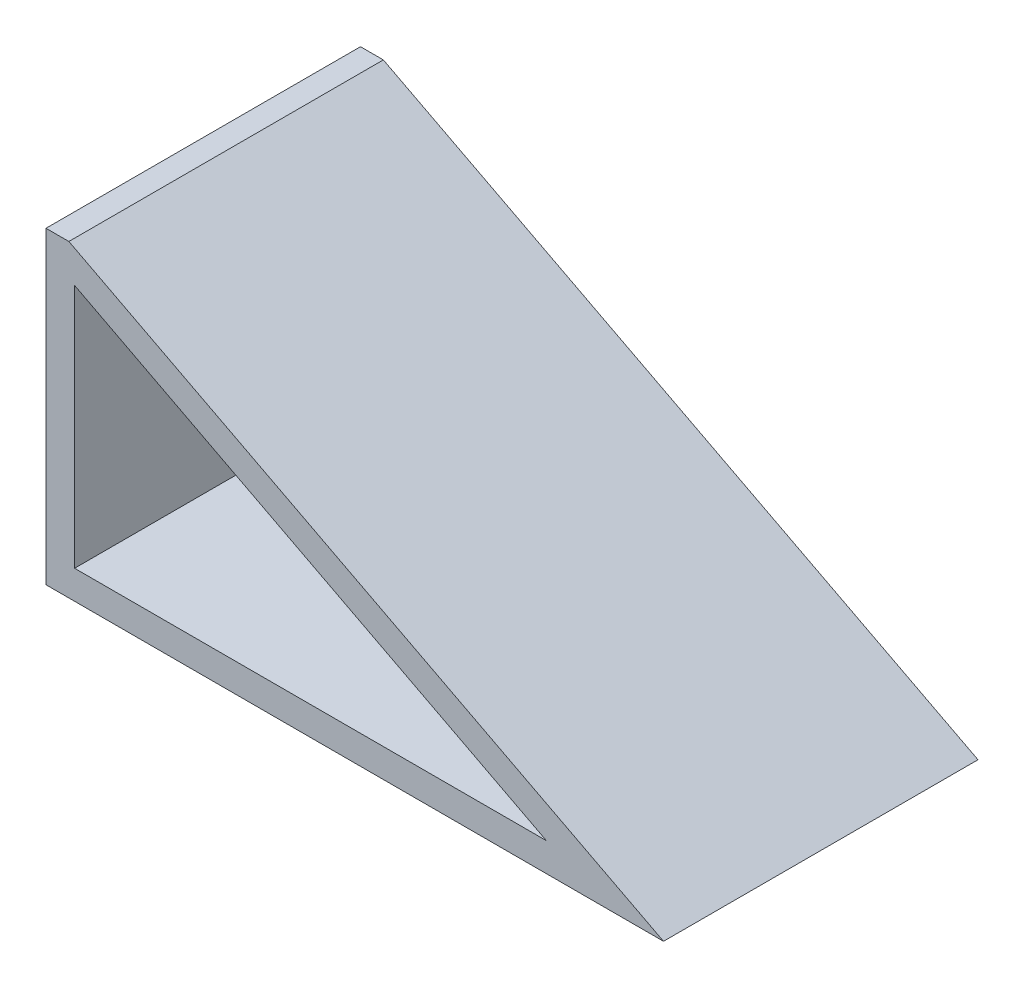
ISO-10303-21;
HEADER;
FILE_DESCRIPTION(('STEP AP214'),'2;1');
FILE_NAME('part.step','',(''),(''),'','','');
FILE_SCHEMA(('AUTOMOTIVE_DESIGN { 1 0 10303 214 1 1 1 1 }'));
ENDSEC;
DATA;
#1=APPLICATION_CONTEXT('core data for automotive mechanical design processes');
#2=APPLICATION_PROTOCOL_DEFINITION('international standard','automotive_design',2000,#1);
#3=PRODUCT_CONTEXT('',#1,'mechanical');
#4=PRODUCT('Part','Part','',(#3));
#5=PRODUCT_RELATED_PRODUCT_CATEGORY('part','',(#4));
#6=PRODUCT_DEFINITION_FORMATION('','',#4);
#7=PRODUCT_DEFINITION_CONTEXT('part definition',#1,'design');
#8=PRODUCT_DEFINITION('design','',#6,#7);
#9=PRODUCT_DEFINITION_SHAPE('','',#8);
#10=(LENGTH_UNIT() NAMED_UNIT(*) SI_UNIT(.MILLI.,.METRE.));
#11=(NAMED_UNIT(*) PLANE_ANGLE_UNIT() SI_UNIT($,.RADIAN.));
#12=(NAMED_UNIT(*) SI_UNIT($,.STERADIAN.) SOLID_ANGLE_UNIT());
#13=UNCERTAINTY_MEASURE_WITH_UNIT(LENGTH_MEASURE(1.E-05),#10,'distance_accuracy_value','');
#14=(GEOMETRIC_REPRESENTATION_CONTEXT(3) GLOBAL_UNCERTAINTY_ASSIGNED_CONTEXT((#13)) GLOBAL_UNIT_ASSIGNED_CONTEXT((#10,
#11,#12)) REPRESENTATION_CONTEXT('',''));
#15=CARTESIAN_POINT('',(0.,0.,0.));
#16=DIRECTION('',(0.,0.,1.));
#17=DIRECTION('',(1.,0.,0.));
#18=AXIS2_PLACEMENT_3D('',#15,#16,#17);
#19=CARTESIAN_POINT('',(0.,0.,34.925));
#20=DIRECTION('',(0.,0.,-1.));
#21=DIRECTION('',(-1.,0.,0.));
#22=AXIS2_PLACEMENT_3D('',#19,#20,#21);
#23=PLANE('',#22);
#24=DIRECTION('',(-1.,0.,0.));
#25=VECTOR('',#24,1.);
#26=CARTESIAN_POINT('',(5.08,68.58,34.925));
#27=LINE('',#26,#25);
#28=CARTESIAN_POINT('',(5.08,68.58,34.925));
#29=VERTEX_POINT('',#28);
#30=CARTESIAN_POINT('',(0.,68.58,34.925));
#31=VERTEX_POINT('',#30);
#32=EDGE_CURVE('E120',#29,#31,#27,.T.);
#33=ORIENTED_EDGE('',*,*,#32,.T.);
#34=DIRECTION('',(0.,-1.,0.));
#35=VECTOR('',#34,1.);
#36=CARTESIAN_POINT('',(0.,0.,34.925));
#37=LINE('',#36,#35);
#38=CARTESIAN_POINT('',(0.,0.,34.925));
#39=VERTEX_POINT('',#38);
#40=EDGE_CURVE('E123',#31,#39,#37,.T.);
#41=ORIENTED_EDGE('',*,*,#40,.T.);
#42=DIRECTION('',(1.,0.,0.));
#43=VECTOR('',#42,1.);
#44=CARTESIAN_POINT('',(137.16,0.,34.925));
#45=LINE('',#44,#43);
#46=CARTESIAN_POINT('',(137.16,0.,34.925));
#47=VERTEX_POINT('',#46);
#48=EDGE_CURVE('E126',#39,#47,#45,.T.);
#49=ORIENTED_EDGE('',*,*,#48,.T.);
#50=DIRECTION('',(-0.88749607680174,0.460815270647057,0.));
#51=VECTOR('',#50,1.);
#52=CARTESIAN_POINT('',(5.08,68.58,34.925));
#53=LINE('',#52,#51);
#54=EDGE_CURVE('E128',#47,#29,#53,.T.);
#55=ORIENTED_EDGE('',*,*,#54,.T.);
#56=EDGE_LOOP('',(#33,#41,#49,#55));
#57=FACE_BOUND('',#56,.T.);
#58=DIRECTION('',(-0.88749607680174,0.460815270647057,0.));
#59=VECTOR('',#58,1.);
#60=CARTESIAN_POINT('',(26.1998469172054,50.4589644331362,34.925));
#61=LINE('',#60,#59);
#62=CARTESIAN_POINT('',(111.150445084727,6.35,34.925));
#63=VERTEX_POINT('',#62);
#64=CARTESIAN_POINT('',(6.35,60.7656157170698,34.925));
#65=VERTEX_POINT('',#64);
#66=EDGE_CURVE('E115',#63,#65,#61,.T.);
#67=ORIENTED_EDGE('',*,*,#66,.F.);
#68=DIRECTION('',(1.,0.,0.));
#69=VECTOR('',#68,1.);
#70=CARTESIAN_POINT('',(0.,6.35,34.925));
#71=LINE('',#70,#69);
#72=CARTESIAN_POINT('',(6.35,6.35,34.925));
#73=VERTEX_POINT('',#72);
#74=EDGE_CURVE('E113',#73,#63,#71,.T.);
#75=ORIENTED_EDGE('',*,*,#74,.F.);
#76=DIRECTION('',(0.,-1.,0.));
#77=VECTOR('',#76,1.);
#78=CARTESIAN_POINT('',(6.35,0.,34.925));
#79=LINE('',#78,#77);
#80=EDGE_CURVE('E94',#65,#73,#79,.T.);
#81=ORIENTED_EDGE('',*,*,#80,.F.);
#82=EDGE_LOOP('',(#67,#75,#81));
#83=FACE_BOUND('',#82,.T.);
#84=ADVANCED_FACE('F32',(#57,#83),#23,.F.);
#85=CARTESIAN_POINT('',(0.,0.,-34.925));
#86=DIRECTION('',(0.,0.,-1.));
#87=DIRECTION('',(-1.,0.,0.));
#88=AXIS2_PLACEMENT_3D('',#85,#86,#87);
#89=PLANE('',#88);
#90=DIRECTION('',(-1.,0.,0.));
#91=VECTOR('',#90,1.);
#92=CARTESIAN_POINT('',(5.08,68.58,-34.925));
#93=LINE('',#92,#91);
#94=CARTESIAN_POINT('',(5.08,68.58,-34.925));
#95=VERTEX_POINT('',#94);
#96=CARTESIAN_POINT('',(0.,68.58,-34.925));
#97=VERTEX_POINT('',#96);
#98=EDGE_CURVE('E119',#95,#97,#93,.T.);
#99=ORIENTED_EDGE('',*,*,#98,.F.);
#100=DIRECTION('',(-0.88749607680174,0.460815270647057,0.));
#101=VECTOR('',#100,1.);
#102=CARTESIAN_POINT('',(5.08,68.58,-34.925));
#103=LINE('',#102,#101);
#104=CARTESIAN_POINT('',(137.16,0.,-34.925));
#105=VERTEX_POINT('',#104);
#106=EDGE_CURVE('E124',#105,#95,#103,.T.);
#107=ORIENTED_EDGE('',*,*,#106,.F.);
#108=DIRECTION('',(1.,0.,0.));
#109=VECTOR('',#108,1.);
#110=CARTESIAN_POINT('',(137.16,0.,-34.925));
#111=LINE('',#110,#109);
#112=CARTESIAN_POINT('',(0.,0.,-34.925));
#113=VERTEX_POINT('',#112);
#114=EDGE_CURVE('E135',#113,#105,#111,.T.);
#115=ORIENTED_EDGE('',*,*,#114,.F.);
#116=DIRECTION('',(0.,-1.,0.));
#117=VECTOR('',#116,1.);
#118=CARTESIAN_POINT('',(0.,0.,-34.925));
#119=LINE('',#118,#117);
#120=EDGE_CURVE('E133',#97,#113,#119,.T.);
#121=ORIENTED_EDGE('',*,*,#120,.F.);
#122=EDGE_LOOP('',(#99,#107,#115,#121));
#123=FACE_BOUND('',#122,.T.);
#124=DIRECTION('',(-0.88749607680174,0.460815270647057,0.));
#125=VECTOR('',#124,1.);
#126=CARTESIAN_POINT('',(26.1998469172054,50.4589644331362,-34.925));
#127=LINE('',#126,#125);
#128=CARTESIAN_POINT('',(111.150445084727,6.35,-34.925));
#129=VERTEX_POINT('',#128);
#130=CARTESIAN_POINT('',(6.35,60.7656157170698,-34.925));
#131=VERTEX_POINT('',#130);
#132=EDGE_CURVE('E102',#129,#131,#127,.T.);
#133=ORIENTED_EDGE('',*,*,#132,.T.);
#134=DIRECTION('',(0.,-1.,0.));
#135=VECTOR('',#134,1.);
#136=CARTESIAN_POINT('',(6.35,0.,-34.925));
#137=LINE('',#136,#135);
#138=CARTESIAN_POINT('',(6.35,6.35,-34.925));
#139=VERTEX_POINT('',#138);
#140=EDGE_CURVE('E91',#131,#139,#137,.T.);
#141=ORIENTED_EDGE('',*,*,#140,.T.);
#142=DIRECTION('',(1.,0.,0.));
#143=VECTOR('',#142,1.);
#144=CARTESIAN_POINT('',(0.,6.35,-34.925));
#145=LINE('',#144,#143);
#146=EDGE_CURVE('E99',#139,#129,#145,.T.);
#147=ORIENTED_EDGE('',*,*,#146,.T.);
#148=EDGE_LOOP('',(#133,#141,#147));
#149=FACE_BOUND('',#148,.T.);
#150=ADVANCED_FACE('F104',(#123,#149),#89,.T.);
#151=CARTESIAN_POINT('',(5.08,68.58,34.925));
#152=DIRECTION('',(0.,-1.,0.));
#153=DIRECTION('',(0.,0.,-1.));
#154=AXIS2_PLACEMENT_3D('',#151,#152,#153);
#155=PLANE('',#154);
#156=ORIENTED_EDGE('',*,*,#98,.T.);
#157=DIRECTION('',(0.,0.,-1.));
#158=VECTOR('',#157,1.);
#159=CARTESIAN_POINT('',(0.,68.58,34.925));
#160=LINE('',#159,#158);
#161=EDGE_CURVE('E11',#31,#97,#160,.T.);
#162=ORIENTED_EDGE('',*,*,#161,.F.);
#163=ORIENTED_EDGE('',*,*,#32,.F.);
#164=DIRECTION('',(0.,0.,-1.));
#165=VECTOR('',#164,1.);
#166=CARTESIAN_POINT('',(5.08,68.58,34.925));
#167=LINE('',#166,#165);
#168=EDGE_CURVE('E130',#29,#95,#167,.T.);
#169=ORIENTED_EDGE('',*,*,#168,.T.);
#170=EDGE_LOOP('',(#156,#162,#163,#169));
#171=FACE_BOUND('',#170,.T.);
#172=ADVANCED_FACE('F34',(#171),#155,.F.);
#173=CARTESIAN_POINT('',(0.,0.,34.925));
#174=DIRECTION('',(1.,0.,0.));
#175=DIRECTION('',(0.,0.,-1.));
#176=AXIS2_PLACEMENT_3D('',#173,#174,#175);
#177=PLANE('',#176);
#178=CARTESIAN_POINT('',(0.,31.75,-17.4625));
#179=DIRECTION('',(-1.,0.,0.));
#180=DIRECTION('',(0.,0.,1.));
#181=AXIS2_PLACEMENT_3D('',#178,#179,#180);
#182=CIRCLE('',#181,4.064);
#183=CARTESIAN_POINT('',(0.,31.75,-13.3985));
#184=VERTEX_POINT('',#183);
#185=EDGE_CURVE('E108',#184,#184,#182,.T.);
#186=ORIENTED_EDGE('',*,*,#185,.F.);
#187=EDGE_LOOP('',(#186));
#188=FACE_BOUND('',#187,.T.);
#189=CARTESIAN_POINT('',(0.,31.75,17.4625));
#190=DIRECTION('',(-1.,0.,0.));
#191=DIRECTION('',(0.,0.,1.));
#192=AXIS2_PLACEMENT_3D('',#189,#190,#191);
#193=CIRCLE('',#192,4.064);
#194=CARTESIAN_POINT('',(0.,31.75,21.5265));
#195=VERTEX_POINT('',#194);
#196=EDGE_CURVE('E214',#195,#195,#193,.T.);
#197=ORIENTED_EDGE('',*,*,#196,.F.);
#198=EDGE_LOOP('',(#197));
#199=FACE_BOUND('',#198,.T.);
#200=ORIENTED_EDGE('',*,*,#120,.T.);
#201=DIRECTION('',(0.,0.,-1.));
#202=VECTOR('',#201,1.);
#203=CARTESIAN_POINT('',(0.,0.,34.925));
#204=LINE('',#203,#202);
#205=EDGE_CURVE('E40',#39,#113,#204,.T.);
#206=ORIENTED_EDGE('',*,*,#205,.F.);
#207=ORIENTED_EDGE('',*,*,#40,.F.);
#208=ORIENTED_EDGE('',*,*,#161,.T.);
#209=EDGE_LOOP('',(#200,#206,#207,#208));
#210=FACE_BOUND('',#209,.T.);
#211=ADVANCED_FACE('F162',(#188,#199,#210),#177,.F.);
#212=CARTESIAN_POINT('',(137.16,0.,34.925));
#213=DIRECTION('',(0.,1.,0.));
#214=DIRECTION('',(0.,0.,1.));
#215=AXIS2_PLACEMENT_3D('',#212,#213,#214);
#216=PLANE('',#215);
#217=ORIENTED_EDGE('',*,*,#114,.T.);
#218=DIRECTION('',(0.,0.,-1.));
#219=VECTOR('',#218,1.);
#220=CARTESIAN_POINT('',(137.16,0.,34.925));
#221=LINE('',#220,#219);
#222=EDGE_CURVE('E140',#47,#105,#221,.T.);
#223=ORIENTED_EDGE('',*,*,#222,.F.);
#224=ORIENTED_EDGE('',*,*,#48,.F.);
#225=ORIENTED_EDGE('',*,*,#205,.T.);
#226=EDGE_LOOP('',(#217,#223,#224,#225));
#227=FACE_BOUND('',#226,.T.);
#228=ADVANCED_FACE('F147',(#227),#216,.F.);
#229=CARTESIAN_POINT('',(5.08,68.58,34.925));
#230=DIRECTION('',(-0.460815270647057,-0.88749607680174,0.));
#231=DIRECTION('',(0.88749607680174,-0.460815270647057,0.));
#232=AXIS2_PLACEMENT_3D('',#229,#230,#231);
#233=PLANE('',#232);
#234=ORIENTED_EDGE('',*,*,#106,.T.);
#235=ORIENTED_EDGE('',*,*,#168,.F.);
#236=ORIENTED_EDGE('',*,*,#54,.F.);
#237=ORIENTED_EDGE('',*,*,#222,.T.);
#238=EDGE_LOOP('',(#234,#235,#236,#237));
#239=FACE_BOUND('',#238,.T.);
#240=ADVANCED_FACE('F155',(#239),#233,.F.);
#241=CARTESIAN_POINT('',(6.35,0.,34.925));
#242=DIRECTION('',(1.,0.,0.));
#243=DIRECTION('',(0.,0.,-1.));
#244=AXIS2_PLACEMENT_3D('',#241,#242,#243);
#245=PLANE('',#244);
#246=ORIENTED_EDGE('',*,*,#80,.T.);
#247=DIRECTION('',(0.,0.,-1.));
#248=VECTOR('',#247,1.);
#249=CARTESIAN_POINT('',(6.34999999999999,6.35,34.925));
#250=LINE('',#249,#248);
#251=EDGE_CURVE('E47',#73,#139,#250,.T.);
#252=ORIENTED_EDGE('',*,*,#251,.T.);
#253=ORIENTED_EDGE('',*,*,#140,.F.);
#254=DIRECTION('',(0.,0.,-1.));
#255=VECTOR('',#254,1.);
#256=CARTESIAN_POINT('',(6.35,60.7656157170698,34.925));
#257=LINE('',#256,#255);
#258=EDGE_CURVE('E96',#65,#131,#257,.T.);
#259=ORIENTED_EDGE('',*,*,#258,.F.);
#260=EDGE_LOOP('',(#246,#252,#253,#259));
#261=FACE_BOUND('',#260,.T.);
#262=ADVANCED_FACE('F89',(#261),#245,.T.);
#263=CARTESIAN_POINT('',(137.16,6.35,34.925));
#264=DIRECTION('',(0.,1.,0.));
#265=DIRECTION('',(0.,0.,1.));
#266=AXIS2_PLACEMENT_3D('',#263,#264,#265);
#267=PLANE('',#266);
#268=ORIENTED_EDGE('',*,*,#146,.F.);
#269=ORIENTED_EDGE('',*,*,#251,.F.);
#270=ORIENTED_EDGE('',*,*,#74,.T.);
#271=DIRECTION('',(0.,0.,-1.));
#272=VECTOR('',#271,1.);
#273=CARTESIAN_POINT('',(111.150445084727,6.35000000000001,34.925));
#274=LINE('',#273,#272);
#275=EDGE_CURVE('E52',#63,#129,#274,.T.);
#276=ORIENTED_EDGE('',*,*,#275,.T.);
#277=EDGE_LOOP('',(#268,#269,#270,#276));
#278=FACE_BOUND('',#277,.T.);
#279=ADVANCED_FACE('F100',(#278),#267,.T.);
#280=CARTESIAN_POINT('',(2.15382303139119,62.944399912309,34.925));
#281=DIRECTION('',(-0.460815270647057,-0.88749607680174,0.));
#282=DIRECTION('',(0.88749607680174,-0.460815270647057,0.));
#283=AXIS2_PLACEMENT_3D('',#280,#281,#282);
#284=PLANE('',#283);
#285=ORIENTED_EDGE('',*,*,#258,.T.);
#286=ORIENTED_EDGE('',*,*,#132,.F.);
#287=ORIENTED_EDGE('',*,*,#275,.F.);
#288=ORIENTED_EDGE('',*,*,#66,.T.);
#289=EDGE_LOOP('',(#285,#286,#287,#288));
#290=FACE_BOUND('',#289,.T.);
#291=ADVANCED_FACE('F179',(#290),#284,.T.);
#292=CARTESIAN_POINT('',(3.048,31.75,17.4625));
#293=DIRECTION('',(-1.,0.,0.));
#294=DIRECTION('',(0.,0.,1.));
#295=AXIS2_PLACEMENT_3D('',#292,#293,#294);
#296=CYLINDRICAL_SURFACE('',#295,4.064);
#297=CARTESIAN_POINT('',(3.048,31.75,17.4625));
#298=DIRECTION('',(-1.,0.,0.));
#299=DIRECTION('',(0.,0.,1.));
#300=AXIS2_PLACEMENT_3D('',#297,#298,#299);
#301=CIRCLE('',#300,4.064);
#302=CARTESIAN_POINT('',(3.048,31.75,21.5265));
#303=VERTEX_POINT('',#302);
#304=EDGE_CURVE('E211',#303,#303,#301,.T.);
#305=CARTESIAN_POINT('',(3.048,31.75,21.5265));
#306=CARTESIAN_POINT('',(3.01625,31.75,21.5265));
#307=CARTESIAN_POINT('',(2.9845,31.75,21.5265));
#308=CARTESIAN_POINT('',(2.921,31.75,21.5265));
#309=CARTESIAN_POINT('',(2.88925,31.75,21.5265));
#310=CARTESIAN_POINT('',(2.82575,31.75,21.5265));
#311=CARTESIAN_POINT('',(2.794,31.75,21.5265));
#312=CARTESIAN_POINT('',(2.7305,31.75,21.5265));
#313=CARTESIAN_POINT('',(2.69875,31.75,21.5265));
#314=CARTESIAN_POINT('',(2.63525,31.75,21.5265));
#315=CARTESIAN_POINT('',(2.6035,31.75,21.5265));
#316=CARTESIAN_POINT('',(2.54,31.75,21.5265));
#317=CARTESIAN_POINT('',(2.50825,31.75,21.5265));
#318=CARTESIAN_POINT('',(2.44475,31.75,21.5265));
#319=CARTESIAN_POINT('',(2.413,31.75,21.5265));
#320=CARTESIAN_POINT('',(2.3495,31.75,21.5265));
#321=CARTESIAN_POINT('',(2.31775,31.75,21.5265));
#322=CARTESIAN_POINT('',(2.25425,31.75,21.5265));
#323=CARTESIAN_POINT('',(2.2225,31.75,21.5265));
#324=CARTESIAN_POINT('',(2.159,31.75,21.5265));
#325=CARTESIAN_POINT('',(2.12725,31.75,21.5265));
#326=CARTESIAN_POINT('',(2.06375,31.75,21.5265));
#327=CARTESIAN_POINT('',(2.032,31.75,21.5265));
#328=CARTESIAN_POINT('',(1.9685,31.75,21.5265));
#329=CARTESIAN_POINT('',(1.93675,31.75,21.5265));
#330=CARTESIAN_POINT('',(1.87325,31.75,21.5265));
#331=CARTESIAN_POINT('',(1.8415,31.75,21.5265));
#332=CARTESIAN_POINT('',(1.778,31.75,21.5265));
#333=CARTESIAN_POINT('',(1.74625,31.75,21.5265));
#334=CARTESIAN_POINT('',(1.68275,31.75,21.5265));
#335=CARTESIAN_POINT('',(1.651,31.75,21.5265));
#336=CARTESIAN_POINT('',(1.5875,31.75,21.5265));
#337=CARTESIAN_POINT('',(1.55575,31.75,21.5265));
#338=CARTESIAN_POINT('',(1.49225,31.75,21.5265));
#339=CARTESIAN_POINT('',(1.4605,31.75,21.5265));
#340=CARTESIAN_POINT('',(1.397,31.75,21.5265));
#341=CARTESIAN_POINT('',(1.36525,31.75,21.5265));
#342=CARTESIAN_POINT('',(1.30175,31.75,21.5265));
#343=CARTESIAN_POINT('',(1.27,31.75,21.5265));
#344=CARTESIAN_POINT('',(1.2065,31.75,21.5265));
#345=CARTESIAN_POINT('',(1.17475,31.75,21.5265));
#346=CARTESIAN_POINT('',(1.11125,31.75,21.5265));
#347=CARTESIAN_POINT('',(1.0795,31.75,21.5265));
#348=CARTESIAN_POINT('',(1.016,31.75,21.5265));
#349=CARTESIAN_POINT('',(0.98425,31.75,21.5265));
#350=CARTESIAN_POINT('',(0.92075,31.75,21.5265));
#351=CARTESIAN_POINT('',(0.889,31.75,21.5265));
#352=CARTESIAN_POINT('',(0.8255,31.75,21.5265));
#353=CARTESIAN_POINT('',(0.79375,31.75,21.5265));
#354=CARTESIAN_POINT('',(0.73025,31.75,21.5265));
#355=CARTESIAN_POINT('',(0.6985,31.75,21.5265));
#356=CARTESIAN_POINT('',(0.635,31.75,21.5265));
#357=CARTESIAN_POINT('',(0.60325,31.75,21.5265));
#358=CARTESIAN_POINT('',(0.53975,31.75,21.5265));
#359=CARTESIAN_POINT('',(0.508,31.75,21.5265));
#360=CARTESIAN_POINT('',(0.4445,31.75,21.5265));
#361=CARTESIAN_POINT('',(0.41275,31.75,21.5265));
#362=CARTESIAN_POINT('',(0.34925,31.75,21.5265));
#363=CARTESIAN_POINT('',(0.3175,31.75,21.5265));
#364=CARTESIAN_POINT('',(0.254,31.75,21.5265));
#365=CARTESIAN_POINT('',(0.22225,31.75,21.5265));
#366=CARTESIAN_POINT('',(0.15875,31.75,21.5265));
#367=CARTESIAN_POINT('',(0.127,31.75,21.5265));
#368=CARTESIAN_POINT('',(0.0634999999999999,31.75,21.5265));
#369=CARTESIAN_POINT('',(0.03175,31.75,21.5265));
#370=CARTESIAN_POINT('',(0.,31.75,21.5265));
#371=B_SPLINE_CURVE_WITH_KNOTS('',3,(#305,#306,#307,#308,#309,#310,#311,#312,#313,#314,#315,
#316,#317,#318,#319,#320,#321,#322,#323,#324,#325,#326,#327,#328,#329,#330,#331,#332,#333,#334,
#335,#336,#337,#338,#339,#340,#341,#342,#343,#344,#345,#346,#347,#348,#349,#350,#351,#352,#353,
#354,#355,#356,#357,#358,#359,#360,#361,#362,#363,#364,#365,#366,#367,#368,#369,#370),
.UNSPECIFIED.,.F.,.F.,(4,2,2,2,2,2,2,2,2,2,2,2,2,2,2,2,2,2,2,2,2,2,2,2,2,2,2,2,2,2,2,2,4),(0.,
0.0952499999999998,0.1905,0.28575,0.381,0.47625,0.5715,0.66675,0.762,0.85725,0.9525,1.04775,
1.143,1.23825,1.3335,1.42875,1.524,1.61925,1.7145,1.80975,1.905,2.00025,2.0955,2.19075,2.286,
2.38125,2.4765,2.57175,2.667,2.76225,2.8575,2.95275,3.048),.UNSPECIFIED.);
#372=EDGE_CURVE('BSEAM191',#303,#195,#371,.T.);
#373=ORIENTED_EDGE('',*,*,#304,.F.);
#374=ORIENTED_EDGE('',*,*,#196,.T.);
#375=ORIENTED_EDGE('',*,*,#372,.T.);
#376=ORIENTED_EDGE('',*,*,#372,.F.);
#377=EDGE_LOOP('',(#373,#375,#374,#376));
#378=FACE_BOUND('',#377,.T.);
#379=ADVANCED_FACE('F191',(#378),#296,.F.);
#380=CARTESIAN_POINT('',(3.048,31.75,17.4625));
#381=DIRECTION('',(-1.,0.,0.));
#382=DIRECTION('',(0.,0.,1.));
#383=AXIS2_PLACEMENT_3D('',#380,#381,#382);
#384=PLANE('',#383);
#385=ORIENTED_EDGE('',*,*,#304,.T.);
#386=EDGE_LOOP('',(#385));
#387=FACE_BOUND('',#386,.T.);
#388=ADVANCED_FACE('F194',(#387),#384,.T.);
#389=CARTESIAN_POINT('',(3.048,31.75,-17.4625));
#390=DIRECTION('',(-1.,0.,0.));
#391=DIRECTION('',(0.,0.,1.));
#392=AXIS2_PLACEMENT_3D('',#389,#390,#391);
#393=CYLINDRICAL_SURFACE('',#392,4.064);
#394=CARTESIAN_POINT('',(3.048,31.75,-17.4625));
#395=DIRECTION('',(-1.,0.,0.));
#396=DIRECTION('',(0.,0.,1.));
#397=AXIS2_PLACEMENT_3D('',#394,#395,#396);
#398=CIRCLE('',#397,4.064);
#399=CARTESIAN_POINT('',(3.048,31.75,-13.3985));
#400=VERTEX_POINT('',#399);
#401=EDGE_CURVE('E105',#400,#400,#398,.T.);
#402=CARTESIAN_POINT('',(3.048,31.75,-13.3985));
#403=CARTESIAN_POINT('',(3.01625,31.75,-13.3985));
#404=CARTESIAN_POINT('',(2.9845,31.75,-13.3985));
#405=CARTESIAN_POINT('',(2.921,31.75,-13.3985));
#406=CARTESIAN_POINT('',(2.88925,31.75,-13.3985));
#407=CARTESIAN_POINT('',(2.82575,31.75,-13.3985));
#408=CARTESIAN_POINT('',(2.794,31.75,-13.3985));
#409=CARTESIAN_POINT('',(2.7305,31.75,-13.3985));
#410=CARTESIAN_POINT('',(2.69875,31.75,-13.3985));
#411=CARTESIAN_POINT('',(2.63525,31.75,-13.3985));
#412=CARTESIAN_POINT('',(2.6035,31.75,-13.3985));
#413=CARTESIAN_POINT('',(2.54,31.75,-13.3985));
#414=CARTESIAN_POINT('',(2.50825,31.75,-13.3985));
#415=CARTESIAN_POINT('',(2.44475,31.75,-13.3985));
#416=CARTESIAN_POINT('',(2.413,31.75,-13.3985));
#417=CARTESIAN_POINT('',(2.3495,31.75,-13.3985));
#418=CARTESIAN_POINT('',(2.31775,31.75,-13.3985));
#419=CARTESIAN_POINT('',(2.25425,31.75,-13.3985));
#420=CARTESIAN_POINT('',(2.2225,31.75,-13.3985));
#421=CARTESIAN_POINT('',(2.159,31.75,-13.3985));
#422=CARTESIAN_POINT('',(2.12725,31.75,-13.3985));
#423=CARTESIAN_POINT('',(2.06375,31.75,-13.3985));
#424=CARTESIAN_POINT('',(2.032,31.75,-13.3985));
#425=CARTESIAN_POINT('',(1.9685,31.75,-13.3985));
#426=CARTESIAN_POINT('',(1.93675,31.75,-13.3985));
#427=CARTESIAN_POINT('',(1.87325,31.75,-13.3985));
#428=CARTESIAN_POINT('',(1.8415,31.75,-13.3985));
#429=CARTESIAN_POINT('',(1.778,31.75,-13.3985));
#430=CARTESIAN_POINT('',(1.74625,31.75,-13.3985));
#431=CARTESIAN_POINT('',(1.68275,31.75,-13.3985));
#432=CARTESIAN_POINT('',(1.651,31.75,-13.3985));
#433=CARTESIAN_POINT('',(1.5875,31.75,-13.3985));
#434=CARTESIAN_POINT('',(1.55575,31.75,-13.3985));
#435=CARTESIAN_POINT('',(1.49225,31.75,-13.3985));
#436=CARTESIAN_POINT('',(1.4605,31.75,-13.3985));
#437=CARTESIAN_POINT('',(1.397,31.75,-13.3985));
#438=CARTESIAN_POINT('',(1.36525,31.75,-13.3985));
#439=CARTESIAN_POINT('',(1.30175,31.75,-13.3985));
#440=CARTESIAN_POINT('',(1.27,31.75,-13.3985));
#441=CARTESIAN_POINT('',(1.2065,31.75,-13.3985));
#442=CARTESIAN_POINT('',(1.17475,31.75,-13.3985));
#443=CARTESIAN_POINT('',(1.11125,31.75,-13.3985));
#444=CARTESIAN_POINT('',(1.0795,31.75,-13.3985));
#445=CARTESIAN_POINT('',(1.016,31.75,-13.3985));
#446=CARTESIAN_POINT('',(0.98425,31.75,-13.3985));
#447=CARTESIAN_POINT('',(0.92075,31.75,-13.3985));
#448=CARTESIAN_POINT('',(0.889,31.75,-13.3985));
#449=CARTESIAN_POINT('',(0.8255,31.75,-13.3985));
#450=CARTESIAN_POINT('',(0.79375,31.75,-13.3985));
#451=CARTESIAN_POINT('',(0.73025,31.75,-13.3985));
#452=CARTESIAN_POINT('',(0.6985,31.75,-13.3985));
#453=CARTESIAN_POINT('',(0.635,31.75,-13.3985));
#454=CARTESIAN_POINT('',(0.60325,31.75,-13.3985));
#455=CARTESIAN_POINT('',(0.53975,31.75,-13.3985));
#456=CARTESIAN_POINT('',(0.508,31.75,-13.3985));
#457=CARTESIAN_POINT('',(0.4445,31.75,-13.3985));
#458=CARTESIAN_POINT('',(0.41275,31.75,-13.3985));
#459=CARTESIAN_POINT('',(0.34925,31.75,-13.3985));
#460=CARTESIAN_POINT('',(0.3175,31.75,-13.3985));
#461=CARTESIAN_POINT('',(0.254,31.75,-13.3985));
#462=CARTESIAN_POINT('',(0.22225,31.75,-13.3985));
#463=CARTESIAN_POINT('',(0.15875,31.75,-13.3985));
#464=CARTESIAN_POINT('',(0.127,31.75,-13.3985));
#465=CARTESIAN_POINT('',(0.0634999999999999,31.75,-13.3985));
#466=CARTESIAN_POINT('',(0.03175,31.75,-13.3985));
#467=CARTESIAN_POINT('',(0.,31.75,-13.3985));
#468=B_SPLINE_CURVE_WITH_KNOTS('',3,(#402,#403,#404,#405,#406,#407,#408,#409,#410,#411,#412,
#413,#414,#415,#416,#417,#418,#419,#420,#421,#422,#423,#424,#425,#426,#427,#428,#429,#430,#431,
#432,#433,#434,#435,#436,#437,#438,#439,#440,#441,#442,#443,#444,#445,#446,#447,#448,#449,#450,
#451,#452,#453,#454,#455,#456,#457,#458,#459,#460,#461,#462,#463,#464,#465,#466,#467),
.UNSPECIFIED.,.F.,.F.,(4,2,2,2,2,2,2,2,2,2,2,2,2,2,2,2,2,2,2,2,2,2,2,2,2,2,2,2,2,2,2,2,4),(0.,
0.0952499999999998,0.1905,0.28575,0.381,0.47625,0.5715,0.66675,0.762,0.85725,0.9525,1.04775,
1.143,1.23825,1.3335,1.42875,1.524,1.61925,1.7145,1.80975,1.905,2.00025,2.0955,2.19075,2.286,
2.38125,2.4765,2.57175,2.667,2.76225,2.8575,2.95275,3.048),.UNSPECIFIED.);
#469=EDGE_CURVE('BSEAM198',#400,#184,#468,.T.);
#470=ORIENTED_EDGE('',*,*,#401,.F.);
#471=ORIENTED_EDGE('',*,*,#185,.T.);
#472=ORIENTED_EDGE('',*,*,#469,.T.);
#473=ORIENTED_EDGE('',*,*,#469,.F.);
#474=EDGE_LOOP('',(#470,#472,#471,#473));
#475=FACE_BOUND('',#474,.T.);
#476=ADVANCED_FACE('F198',(#475),#393,.F.);
#477=CARTESIAN_POINT('',(3.048,31.75,-17.4625));
#478=DIRECTION('',(-1.,0.,0.));
#479=DIRECTION('',(0.,0.,1.));
#480=AXIS2_PLACEMENT_3D('',#477,#478,#479);
#481=PLANE('',#480);
#482=ORIENTED_EDGE('',*,*,#401,.T.);
#483=EDGE_LOOP('',(#482));
#484=FACE_BOUND('',#483,.T.);
#485=ADVANCED_FACE('F202',(#484),#481,.T.);
#486=CLOSED_SHELL('',(#84,#150,#172,#211,#228,#240,#262,#279,#291,#379,#388,#476,#485));
#487=MANIFOLD_SOLID_BREP('B2',#486);
#488=ADVANCED_BREP_SHAPE_REPRESENTATION('',(#18,#487),#14);
#489=SHAPE_DEFINITION_REPRESENTATION(#9,#488);
ENDSEC;
END-ISO-10303-21;
